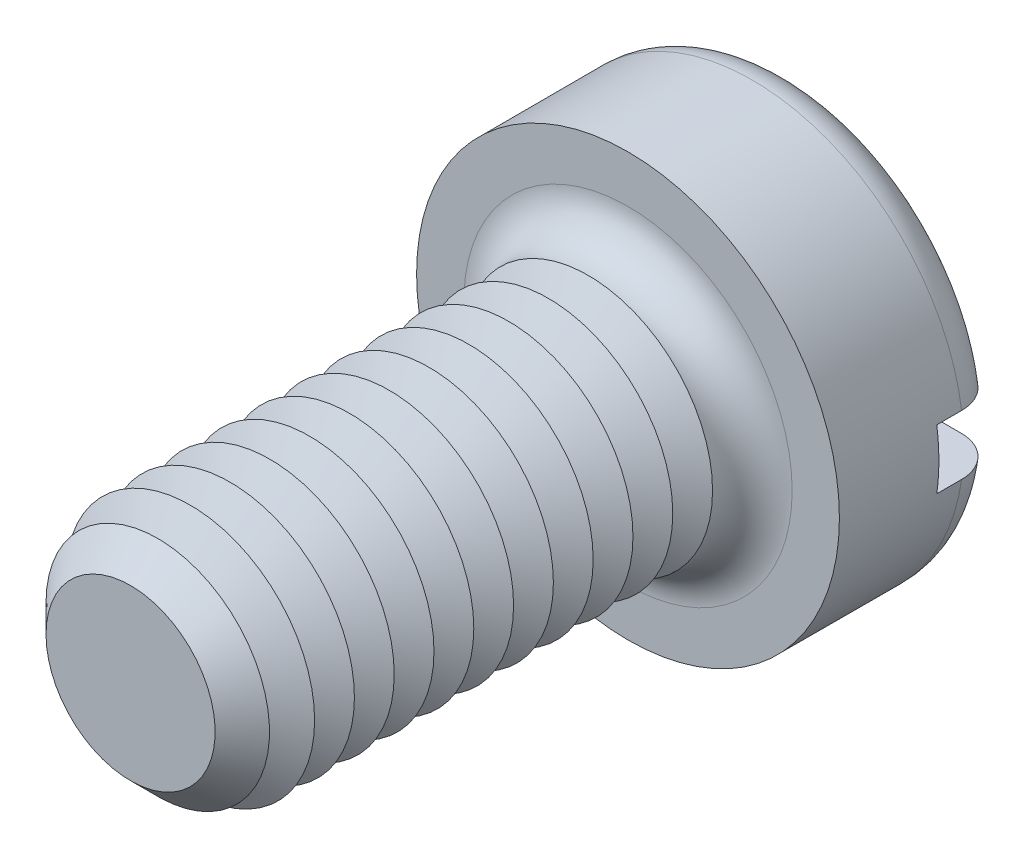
ISO-10303-21;
HEADER;
FILE_DESCRIPTION(('STEP AP214'),'2;1');
FILE_NAME('part.step','',(''),(''),'','','');
FILE_SCHEMA(('AUTOMOTIVE_DESIGN { 1 0 10303 214 1 1 1 1 }'));
ENDSEC;
DATA;
#1=APPLICATION_CONTEXT('core data for automotive mechanical design processes');
#2=APPLICATION_PROTOCOL_DEFINITION('international standard','automotive_design',2000,#1);
#3=PRODUCT_CONTEXT('',#1,'mechanical');
#4=PRODUCT('Part','Part','',(#3));
#5=PRODUCT_RELATED_PRODUCT_CATEGORY('part','',(#4));
#6=PRODUCT_DEFINITION_FORMATION('','',#4);
#7=PRODUCT_DEFINITION_CONTEXT('part definition',#1,'design');
#8=PRODUCT_DEFINITION('design','',#6,#7);
#9=PRODUCT_DEFINITION_SHAPE('','',#8);
#10=(LENGTH_UNIT() NAMED_UNIT(*) SI_UNIT(.MILLI.,.METRE.));
#11=(NAMED_UNIT(*) PLANE_ANGLE_UNIT() SI_UNIT($,.RADIAN.));
#12=(NAMED_UNIT(*) SI_UNIT($,.STERADIAN.) SOLID_ANGLE_UNIT());
#13=UNCERTAINTY_MEASURE_WITH_UNIT(LENGTH_MEASURE(1.E-05),#10,'distance_accuracy_value','');
#14=(GEOMETRIC_REPRESENTATION_CONTEXT(3) GLOBAL_UNCERTAINTY_ASSIGNED_CONTEXT((#13)) GLOBAL_UNIT_ASSIGNED_CONTEXT((#10,
#11,#12)) REPRESENTATION_CONTEXT('',''));
#15=CARTESIAN_POINT('',(0.,0.,0.));
#16=DIRECTION('',(0.,0.,1.));
#17=DIRECTION('',(1.,0.,0.));
#18=AXIS2_PLACEMENT_3D('',#15,#16,#17);
#19=CARTESIAN_POINT('',(0.,0.,-3.3));
#20=DIRECTION('',(0.,0.,1.));
#21=DIRECTION('',(1.,0.,0.));
#22=AXIS2_PLACEMENT_3D('',#19,#20,#21);
#23=PLANE('',#22);
#24=CARTESIAN_POINT('',(0.,0.,-3.3));
#25=DIRECTION('',(0.,0.,1.));
#26=DIRECTION('',(1.,0.,0.));
#27=AXIS2_PLACEMENT_3D('',#24,#25,#26);
#28=CIRCLE('',#27,3.45);
#29=CARTESIAN_POINT('',(-3.39742549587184,0.6,-3.3));
#30=VERTEX_POINT('',#29);
#31=CARTESIAN_POINT('',(3.39742549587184,0.6,-3.3));
#32=VERTEX_POINT('',#31);
#33=EDGE_CURVE('E116',#30,#32,#28,.F.);
#34=ORIENTED_EDGE('',*,*,#33,.T.);
#35=DIRECTION('',(1.,0.,0.));
#36=VECTOR('',#35,1.);
#37=CARTESIAN_POINT('',(-4.25,0.600000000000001,-3.3));
#38=LINE('',#37,#36);
#39=EDGE_CURVE('E111',#30,#32,#38,.T.);
#40=ORIENTED_EDGE('',*,*,#39,.F.);
#41=EDGE_LOOP('',(#34,#40));
#42=FACE_BOUND('',#41,.T.);
#43=ADVANCED_FACE('F39',(#42),#23,.F.);
#44=CARTESIAN_POINT('',(0.,0.,-2.5));
#45=DIRECTION('',(0.,0.,1.));
#46=DIRECTION('',(1.,0.,0.));
#47=AXIS2_PLACEMENT_3D('',#44,#45,#46);
#48=TOROIDAL_SURFACE('',#47,3.45,0.8);
#49=CARTESIAN_POINT('',(-4.06369072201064,0.600000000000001,-2.95537828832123));
#50=CARTESIAN_POINT('',(-4.03774340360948,0.600000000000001,-2.99245078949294));
#51=CARTESIAN_POINT('',(-4.00861849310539,0.600000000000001,-3.02734231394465));
#52=CARTESIAN_POINT('',(-3.94488199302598,0.600000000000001,-3.0917502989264));
#53=CARTESIAN_POINT('',(-3.91026320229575,0.600000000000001,-3.12125959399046));
#54=CARTESIAN_POINT('',(-3.83660561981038,0.600000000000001,-3.17403695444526));
#55=CARTESIAN_POINT('',(-3.79757117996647,0.6,-3.19731109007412));
#56=CARTESIAN_POINT('',(-3.71618817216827,0.6,-3.23703443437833));
#57=CARTESIAN_POINT('',(-3.67384041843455,0.6,-3.25348531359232));
#58=CARTESIAN_POINT('',(-3.58661930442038,0.6,-3.2792758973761));
#59=CARTESIAN_POINT('',(-3.54172669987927,0.6,-3.288550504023));
#60=CARTESIAN_POINT('',(-3.45102322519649,0.6,-3.29952632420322));
#61=CARTESIAN_POINT('',(-3.40521225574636,0.6,-3.30122671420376));
#62=CARTESIAN_POINT('',(-3.31340831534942,0.6,-3.29701196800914));
#63=CARTESIAN_POINT('',(-3.26741940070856,0.6,-3.29100823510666));
#64=CARTESIAN_POINT('',(-3.17708556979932,0.6,-3.27141469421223));
#65=CARTESIAN_POINT('',(-3.13274074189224,0.6,-3.25782447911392));
#66=CARTESIAN_POINT('',(-3.0466814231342,0.6,-3.22332549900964));
#67=CARTESIAN_POINT('',(-3.00498444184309,0.6,-3.20237301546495));
#68=CARTESIAN_POINT('',(-2.92572251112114,0.6,-3.15372961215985));
#69=CARTESIAN_POINT('',(-2.88815755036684,0.6,-3.12603871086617));
#70=CARTESIAN_POINT('',(-2.81847654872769,0.6,-3.06483322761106));
#71=CARTESIAN_POINT('',(-2.78633186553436,0.6,-3.03135128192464));
#72=CARTESIAN_POINT('',(-2.72824805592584,0.6,-2.95937651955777));
#73=CARTESIAN_POINT('',(-2.70230829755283,0.6,-2.92088421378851));
#74=CARTESIAN_POINT('',(-2.65791262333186,0.6,-2.84074227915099));
#75=CARTESIAN_POINT('',(-2.63932560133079,0.6,-2.79916531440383));
#76=CARTESIAN_POINT('',(-2.60958432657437,0.6,-2.7134333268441));
#77=CARTESIAN_POINT('',(-2.59842889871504,0.6,-2.66927871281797));
#78=CARTESIAN_POINT('',(-2.58411140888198,0.6,-2.58073966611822));
#79=CARTESIAN_POINT('',(-2.58077086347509,0.6,-2.5363840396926));
#80=CARTESIAN_POINT('',(-2.58167367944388,0.6,-2.44775208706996));
#81=CARTESIAN_POINT('',(-2.58591644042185,0.6,-2.40347575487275));
#82=CARTESIAN_POINT('',(-2.60175154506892,0.6,-2.31675105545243));
#83=CARTESIAN_POINT('',(-2.61326489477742,0.6,-2.27428821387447));
#84=CARTESIAN_POINT('',(-2.6431863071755,0.6,-2.19186794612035));
#85=CARTESIAN_POINT('',(-2.66159465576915,0.6,-2.15191062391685));
#86=CARTESIAN_POINT('',(-2.70494650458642,0.6,-2.07517696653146));
#87=CARTESIAN_POINT('',(-2.72995486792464,0.6,-2.03843731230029));
#88=CARTESIAN_POINT('',(-2.7856570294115,0.6,-1.96955746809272));
#89=CARTESIAN_POINT('',(-2.81635145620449,0.6,-1.93741778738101));
#90=CARTESIAN_POINT('',(-2.88329572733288,0.6,-1.87788048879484));
#91=CARTESIAN_POINT('',(-2.91965530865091,0.6,-1.85060625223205));
#92=CARTESIAN_POINT('',(-2.9963658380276,0.6,-1.80241044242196));
#93=CARTESIAN_POINT('',(-3.03671721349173,0.6,-1.78148955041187));
#94=CARTESIAN_POINT('',(-3.12111125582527,0.6,-1.74619829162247));
#95=CARTESIAN_POINT('',(-3.16521020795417,0.6,-1.73196239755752));
#96=CARTESIAN_POINT('',(-3.25516487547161,0.6,-1.71103773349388));
#97=CARTESIAN_POINT('',(-3.30102068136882,0.6,-1.70434935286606));
#98=CARTESIAN_POINT('',(-3.39352689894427,0.6,-1.69870104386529));
#99=CARTESIAN_POINT('',(-3.44018061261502,0.6,-1.69979487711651));
#100=CARTESIAN_POINT('',(-3.53263583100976,0.6,-1.70983959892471));
#101=CARTESIAN_POINT('',(-3.57843734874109,0.6,-1.71879036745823));
#102=CARTESIAN_POINT('',(-3.66763544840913,0.6,-1.74426972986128));
#103=CARTESIAN_POINT('',(-3.71104292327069,0.6,-1.76076015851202));
#104=CARTESIAN_POINT('',(-3.79442616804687,0.6,-1.80087686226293));
#105=CARTESIAN_POINT('',(-3.83440212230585,0.600000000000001,-1.82450275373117));
#106=CARTESIAN_POINT('',(-3.90929765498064,0.600000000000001,-1.87793548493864));
#107=CARTESIAN_POINT('',(-3.94426963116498,0.600000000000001,-1.90766887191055));
#108=CARTESIAN_POINT('',(-4.00864839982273,0.600000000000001,-1.9726503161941));
#109=CARTESIAN_POINT('',(-4.03805555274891,0.600000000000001,-2.00789801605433));
#110=CARTESIAN_POINT('',(-4.09009460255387,0.600000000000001,-2.08244463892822));
#111=CARTESIAN_POINT('',(-4.11280448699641,0.600000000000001,-2.12168912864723));
#112=CARTESIAN_POINT('',(-4.15124086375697,0.600000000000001,-2.2034588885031));
#113=CARTESIAN_POINT('',(-4.16696802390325,0.600000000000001,-2.24598384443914));
#114=CARTESIAN_POINT('',(-4.19085131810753,0.600000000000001,-2.33267862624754));
#115=CARTESIAN_POINT('',(-4.19907708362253,0.600000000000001,-2.37682928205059));
#116=CARTESIAN_POINT('',(-4.2079638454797,0.600000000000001,-2.46589754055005));
#117=CARTESIAN_POINT('',(-4.20862315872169,0.600000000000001,-2.51081531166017));
#118=CARTESIAN_POINT('',(-4.20236829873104,0.600000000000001,-2.59993343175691));
#119=CARTESIAN_POINT('',(-4.19548454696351,0.600000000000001,-2.64413593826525));
#120=CARTESIAN_POINT('',(-4.17439924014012,0.600000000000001,-2.73071930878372));
#121=CARTESIAN_POINT('',(-4.16020675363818,0.600000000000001,-2.77310235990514));
#122=CARTESIAN_POINT('',(-4.1318825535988,0.600000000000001,-2.83880495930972));
#123=CARTESIAN_POINT('',(-4.11991183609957,0.600000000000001,-2.86307959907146));
#124=CARTESIAN_POINT('',(-4.09356927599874,0.600000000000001,-2.91028856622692));
#125=CARTESIAN_POINT('',(-4.07919744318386,0.600000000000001,-2.9332228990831));
#126=CARTESIAN_POINT('',(-4.06369072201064,0.600000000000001,-2.95537828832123));
#127=B_SPLINE_CURVE_WITH_KNOTS('',3,(#49,#50,#51,#52,#53,#54,#55,#56,#57,#58,#59,#60,#61,#62,
#63,#64,#65,#66,#67,#68,#69,#70,#71,#72,#73,#74,#75,#76,#77,#78,#79,#80,#81,#82,#83,#84,#85,#86,
#87,#88,#89,#90,#91,#92,#93,#94,#95,#96,#97,#98,#99,#100,#101,#102,#103,#104,#105,#106,#107,
#108,#109,#110,#111,#112,#113,#114,#115,#116,#117,#118,#119,#120,#121,#122,#123,#124,#125,#126),
.UNSPECIFIED.,.T.,.F.,(4,2,2,2,2,2,2,2,2,2,2,2,2,2,2,2,2,2,2,2,2,2,2,2,2,2,2,2,2,2,2,2,2,2,2,2,
2,2,4),(0.,0.13565225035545,0.271483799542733,0.407182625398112,0.542848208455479,
0.679730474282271,0.816627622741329,0.955113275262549,1.09360635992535,1.23293614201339,
1.37226554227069,1.51083389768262,1.64938813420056,1.78534653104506,1.92128342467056,
2.0540840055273,2.18687407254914,2.31824564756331,2.44962267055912,2.58234229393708,
2.71507659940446,2.85080630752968,2.98655056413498,3.12491938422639,3.26329534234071,
3.40262816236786,3.54195885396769,3.68059194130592,3.81921757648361,3.95626453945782,
4.09330262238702,4.2286754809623,4.36403538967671,4.49812564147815,4.63224572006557,
4.76582687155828,4.89924267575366,4.98031194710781,5.0613808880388),.UNSPECIFIED.);
#128=CARTESIAN_POINT('',(-4.20743389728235,0.600000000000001,-2.50000000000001));
#129=VERTEX_POINT('',#128);
#130=EDGE_CURVE('E273',#129,#30,#127,.T.);
#131=ORIENTED_EDGE('',*,*,#130,.F.);
#132=CARTESIAN_POINT('',(0.,0.,-2.5));
#133=DIRECTION('',(0.,0.,1.));
#134=DIRECTION('',(1.,0.,0.));
#135=AXIS2_PLACEMENT_3D('',#132,#133,#134);
#136=CIRCLE('',#135,4.25);
#137=CARTESIAN_POINT('',(4.20743389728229,0.599999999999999,-2.5));
#138=VERTEX_POINT('',#137);
#139=EDGE_CURVE('E125',#138,#129,#136,.T.);
#140=ORIENTED_EDGE('',*,*,#139,.F.);
#141=CARTESIAN_POINT('',(2.63947327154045,0.6,-2.79608831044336));
#142=CARTESIAN_POINT('',(2.65655980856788,0.6,-2.83790320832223));
#143=CARTESIAN_POINT('',(2.67725642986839,0.6,-2.87828303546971));
#144=CARTESIAN_POINT('',(2.72519250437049,0.6,-2.95500233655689));
#145=CARTESIAN_POINT('',(2.75244152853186,0.6,-2.9913357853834));
#146=CARTESIAN_POINT('',(2.81257938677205,0.6,-3.05889430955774));
#147=CARTESIAN_POINT('',(2.84545995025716,0.6,-3.09012674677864));
#148=CARTESIAN_POINT('',(2.91591143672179,0.6,-3.14672620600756));
#149=CARTESIAN_POINT('',(2.95348119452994,0.6,-3.17209468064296));
#150=CARTESIAN_POINT('',(3.03291143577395,0.6,-3.21669611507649));
#151=CARTESIAN_POINT('',(3.07483186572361,0.6,-3.23582234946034));
#152=CARTESIAN_POINT('',(3.16126659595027,0.6,-3.26686062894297));
#153=CARTESIAN_POINT('',(3.2057811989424,0.6,-3.27877183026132));
#154=CARTESIAN_POINT('',(3.29669878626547,0.6,-3.29514603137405));
#155=CARTESIAN_POINT('',(3.34311773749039,0.6,-3.29952056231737));
#156=CARTESIAN_POINT('',(3.43603189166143,0.6,-3.30040472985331));
#157=CARTESIAN_POINT('',(3.48252709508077,0.6,-3.29691431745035));
#158=CARTESIAN_POINT('',(3.57420049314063,0.6,-3.28214240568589));
#159=CARTESIAN_POINT('',(3.61938038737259,0.6,-3.27087147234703));
#160=CARTESIAN_POINT('',(3.70717477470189,0.6,-3.24082890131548));
#161=CARTESIAN_POINT('',(3.74978938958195,0.6,-3.22205762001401));
#162=CARTESIAN_POINT('',(3.83078828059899,0.6,-3.17773607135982));
#163=CARTESIAN_POINT('',(3.86921015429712,0.599999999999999,-3.15225453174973));
#164=CARTESIAN_POINT('',(3.94116038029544,0.599999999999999,-3.09512672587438));
#165=CARTESIAN_POINT('',(3.9746890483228,0.599999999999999,-3.06348085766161));
#166=CARTESIAN_POINT('',(4.03545911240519,0.599999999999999,-2.99534640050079));
#167=CARTESIAN_POINT('',(4.06277344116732,0.599999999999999,-2.95892285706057));
#168=CARTESIAN_POINT('',(4.11082191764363,0.599999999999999,-2.88196698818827));
#169=CARTESIAN_POINT('',(4.13155647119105,0.599999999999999,-2.84143491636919));
#170=CARTESIAN_POINT('',(4.16563480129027,0.599999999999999,-2.75787550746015));
#171=CARTESIAN_POINT('',(4.1790544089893,0.599999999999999,-2.71487908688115));
#172=CARTESIAN_POINT('',(4.19843340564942,0.599999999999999,-2.62723691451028));
#173=CARTESIAN_POINT('',(4.20439310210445,0.599999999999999,-2.58259123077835));
#174=CARTESIAN_POINT('',(4.2086595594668,0.599999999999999,-2.49321831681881));
#175=CARTESIAN_POINT('',(4.20701422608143,0.599999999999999,-2.4484933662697));
#176=CARTESIAN_POINT('',(4.1962295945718,0.599999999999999,-2.35995704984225));
#177=CARTESIAN_POINT('',(4.18709040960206,0.599999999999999,-2.31614567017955));
#178=CARTESIAN_POINT('',(4.16160290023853,0.599999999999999,-2.23072100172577));
#179=CARTESIAN_POINT('',(4.14526169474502,0.599999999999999,-2.18910558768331));
#180=CARTESIAN_POINT('',(4.10585410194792,0.599999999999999,-2.10919238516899));
#181=CARTESIAN_POINT('',(4.08278762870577,0.599999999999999,-2.07089463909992));
#182=CARTESIAN_POINT('',(4.030487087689,0.599999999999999,-1.99851484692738));
#183=CARTESIAN_POINT('',(4.00122628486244,0.599999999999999,-1.9644521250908));
#184=CARTESIAN_POINT('',(3.93744772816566,0.599999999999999,-1.90166877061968));
#185=CARTESIAN_POINT('',(3.90292977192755,0.599999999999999,-1.87294834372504));
#186=CARTESIAN_POINT('',(3.82928727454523,0.599999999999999,-1.82137853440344));
#187=CARTESIAN_POINT('',(3.79012374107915,0.6,-1.79858484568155));
#188=CARTESIAN_POINT('',(3.70856025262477,0.6,-1.75980712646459));
#189=CARTESIAN_POINT('',(3.66616010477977,0.6,-1.74382350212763));
#190=CARTESIAN_POINT('',(3.57878495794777,0.6,-1.71891499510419));
#191=CARTESIAN_POINT('',(3.53378519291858,0.6,-1.71007699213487));
#192=CARTESIAN_POINT('',(3.44294322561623,0.6,-1.69998722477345));
#193=CARTESIAN_POINT('',(3.3971009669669,0.6,-1.69873596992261));
#194=CARTESIAN_POINT('',(3.30531297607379,0.6,-1.70385439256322));
#195=CARTESIAN_POINT('',(3.25937213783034,0.6,-1.71031204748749));
#196=CARTESIAN_POINT('',(3.1692099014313,0.6,-1.73080107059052));
#197=CARTESIAN_POINT('',(3.12498860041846,0.6,-1.74483286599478));
#198=CARTESIAN_POINT('',(3.03926209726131,0.6,-1.78018941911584));
#199=CARTESIAN_POINT('',(2.99777407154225,0.6,-1.80155586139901));
#200=CARTESIAN_POINT('',(2.91899881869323,0.6,-1.85098881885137));
#201=CARTESIAN_POINT('',(2.88171158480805,0.6,-1.8790553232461));
#202=CARTESIAN_POINT('',(2.81266124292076,0.6,-1.94094884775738));
#203=CARTESIAN_POINT('',(2.78086710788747,0.6,-1.97474122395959));
#204=CARTESIAN_POINT('',(2.72353615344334,0.6,-2.0472724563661));
#205=CARTESIAN_POINT('',(2.69799841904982,0.6,-2.08601058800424));
#206=CARTESIAN_POINT('',(2.65444718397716,0.6,-2.16655019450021));
#207=CARTESIAN_POINT('',(2.63629889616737,0.6,-2.20827875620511));
#208=CARTESIAN_POINT('',(2.60744942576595,0.6,-2.29424821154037));
#209=CARTESIAN_POINT('',(2.59674901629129,0.6,-2.33848936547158));
#210=CARTESIAN_POINT('',(2.5833312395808,0.6,-2.42714258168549));
#211=CARTESIAN_POINT('',(2.58043995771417,0.6,-2.47152848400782));
#212=CARTESIAN_POINT('',(2.58224493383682,0.6,-2.56010574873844));
#213=CARTESIAN_POINT('',(2.58693104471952,0.6,-2.60429729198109));
#214=CARTESIAN_POINT('',(2.60020046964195,0.6,-2.67311978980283));
#215=CARTESIAN_POINT('',(2.60635343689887,0.6,-2.69824441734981));
#216=CARTESIAN_POINT('',(2.62110140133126,0.6,-2.74776540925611));
#217=CARTESIAN_POINT('',(2.62969634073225,0.6,-2.77216179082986));
#218=CARTESIAN_POINT('',(2.63947327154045,0.6,-2.79608831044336));
#219=B_SPLINE_CURVE_WITH_KNOTS('',3,(#141,#142,#143,#144,#145,#146,#147,#148,#149,#150,#151,
#152,#153,#154,#155,#156,#157,#158,#159,#160,#161,#162,#163,#164,#165,#166,#167,#168,#169,#170,
#171,#172,#173,#174,#175,#176,#177,#178,#179,#180,#181,#182,#183,#184,#185,#186,#187,#188,#189,
#190,#191,#192,#193,#194,#195,#196,#197,#198,#199,#200,#201,#202,#203,#204,#205,#206,#207,#208,
#209,#210,#211,#212,#213,#214,#215,#216,#217,#218),.UNSPECIFIED.,.T.,.F.,(4,2,2,2,2,2,2,2,2,2,2,
2,2,2,2,2,2,2,2,2,2,2,2,2,2,2,2,2,2,2,2,2,2,2,2,2,2,2,4),(0.,0.135416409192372,
0.271031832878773,0.406449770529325,0.541834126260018,0.679424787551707,0.817031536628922,
0.956242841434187,1.09545501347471,1.23447850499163,1.37349539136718,1.51114036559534,
1.64877645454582,1.78470267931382,1.92062051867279,2.05510117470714,2.1895762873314,
2.32320547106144,2.45683263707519,2.59032801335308,2.72382509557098,2.85791055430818,
2.99200117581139,3.12730969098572,3.26262627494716,3.39956435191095,3.53651162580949,
3.67503685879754,3.81356990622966,3.95290367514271,4.09223721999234,4.23075602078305,
4.36925455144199,4.50509949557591,4.6409585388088,4.77376594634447,4.90639565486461,
4.98388287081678,5.06136825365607),.UNSPECIFIED.);
#220=EDGE_CURVE('E275',#32,#138,#219,.T.);
#221=ORIENTED_EDGE('',*,*,#220,.F.);
#222=ORIENTED_EDGE('',*,*,#33,.F.);
#223=EDGE_LOOP('',(#131,#140,#221,#222));
#224=FACE_BOUND('',#223,.T.);
#225=ADVANCED_FACE('F257',(#224),#48,.T.);
#226=CARTESIAN_POINT('',(0.,0.,-3.3));
#227=DIRECTION('',(0.,0.,1.));
#228=DIRECTION('',(1.,0.,0.));
#229=AXIS2_PLACEMENT_3D('',#226,#227,#228);
#230=CYLINDRICAL_SURFACE('',#229,4.25);
#231=DIRECTION('',(0.,0.,1.));
#232=VECTOR('',#231,1.);
#233=CARTESIAN_POINT('',(4.20743389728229,0.599999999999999,-3.3));
#234=LINE('',#233,#232);
#235=CARTESIAN_POINT('',(4.20743389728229,0.599999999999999,-2.));
#236=VERTEX_POINT('',#235);
#237=EDGE_CURVE('E290',#138,#236,#234,.T.);
#238=ORIENTED_EDGE('',*,*,#237,.F.);
#239=ORIENTED_EDGE('',*,*,#139,.T.);
#240=DIRECTION('',(0.,0.,1.));
#241=VECTOR('',#240,1.);
#242=CARTESIAN_POINT('',(-4.20743389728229,0.600000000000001,-3.3));
#243=LINE('',#242,#241);
#244=CARTESIAN_POINT('',(-4.20743389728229,0.600000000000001,-2.));
#245=VERTEX_POINT('',#244);
#246=EDGE_CURVE('E63',#245,#129,#243,.F.);
#247=ORIENTED_EDGE('',*,*,#246,.F.);
#248=CARTESIAN_POINT('',(0.,0.,-2.));
#249=DIRECTION('',(0.,0.,-1.));
#250=DIRECTION('',(-1.,0.,0.));
#251=AXIS2_PLACEMENT_3D('',#248,#249,#250);
#252=CIRCLE('',#251,4.25);
#253=CARTESIAN_POINT('',(-4.20743389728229,-0.599999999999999,-2.));
#254=VERTEX_POINT('',#253);
#255=EDGE_CURVE('E43',#245,#254,#252,.F.);
#256=ORIENTED_EDGE('',*,*,#255,.T.);
#257=DIRECTION('',(0.,0.,1.));
#258=VECTOR('',#257,1.);
#259=CARTESIAN_POINT('',(-4.20743389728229,-0.599999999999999,-3.3));
#260=LINE('',#259,#258);
#261=CARTESIAN_POINT('',(-4.20743389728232,-0.599999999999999,-2.5));
#262=VERTEX_POINT('',#261);
#263=EDGE_CURVE('E287',#262,#254,#260,.T.);
#264=ORIENTED_EDGE('',*,*,#263,.F.);
#265=CARTESIAN_POINT('',(4.20743389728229,-0.600000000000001,-2.5));
#266=VERTEX_POINT('',#265);
#267=EDGE_CURVE('E127',#262,#266,#136,.T.);
#268=ORIENTED_EDGE('',*,*,#267,.T.);
#269=DIRECTION('',(0.,0.,1.));
#270=VECTOR('',#269,1.);
#271=CARTESIAN_POINT('',(4.20743389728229,-0.600000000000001,-3.3));
#272=LINE('',#271,#270);
#273=CARTESIAN_POINT('',(4.20743389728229,-0.600000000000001,-2.));
#274=VERTEX_POINT('',#273);
#275=EDGE_CURVE('E55',#274,#266,#272,.F.);
#276=ORIENTED_EDGE('',*,*,#275,.F.);
#277=EDGE_CURVE('E11',#274,#236,#252,.F.);
#278=ORIENTED_EDGE('',*,*,#277,.T.);
#279=EDGE_LOOP('',(#238,#239,#247,#256,#264,#268,#276,#278));
#280=FACE_BOUND('',#279,.T.);
#281=CARTESIAN_POINT('',(0.,0.,0.));
#282=DIRECTION('',(0.,0.,1.));
#283=DIRECTION('',(1.,0.,0.));
#284=AXIS2_PLACEMENT_3D('',#281,#282,#283);
#285=CIRCLE('',#284,4.25);
#286=CARTESIAN_POINT('',(4.25,0.,0.));
#287=VERTEX_POINT('',#286);
#288=EDGE_CURVE('E293',#287,#287,#285,.T.);
#289=ORIENTED_EDGE('',*,*,#288,.F.);
#290=EDGE_LOOP('',(#289));
#291=FACE_BOUND('',#290,.T.);
#292=ADVANCED_FACE('F253',(#280,#291),#230,.T.);
#293=CARTESIAN_POINT('',(3.39742549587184,-0.6,-3.3));
#294=VERTEX_POINT('',#293);
#295=CARTESIAN_POINT('',(-3.39742549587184,-0.6,-3.3));
#296=VERTEX_POINT('',#295);
#297=EDGE_CURVE('E109',#294,#296,#28,.F.);
#298=ORIENTED_EDGE('',*,*,#297,.T.);
#299=DIRECTION('',(-1.,0.,0.));
#300=VECTOR('',#299,1.);
#301=CARTESIAN_POINT('',(-4.25,-0.599999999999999,-3.3));
#302=LINE('',#301,#300);
#303=EDGE_CURVE('E96',#294,#296,#302,.T.);
#304=ORIENTED_EDGE('',*,*,#303,.F.);
#305=EDGE_LOOP('',(#298,#304));
#306=FACE_BOUND('',#305,.T.);
#307=ADVANCED_FACE('F108',(#306),#23,.F.);
#308=CARTESIAN_POINT('',(0.,0.,0.));
#309=DIRECTION('',(0.,0.,1.));
#310=DIRECTION('',(1.,0.,0.));
#311=AXIS2_PLACEMENT_3D('',#308,#309,#310);
#312=PLANE('',#311);
#313=CARTESIAN_POINT('',(0.,0.,0.));
#314=DIRECTION('',(0.,0.,1.));
#315=DIRECTION('',(1.,0.,0.));
#316=AXIS2_PLACEMENT_3D('',#313,#314,#315);
#317=CIRCLE('',#316,3.3);
#318=CARTESIAN_POINT('',(3.3,0.,0.));
#319=VERTEX_POINT('',#318);
#320=EDGE_CURVE('E115',#319,#319,#317,.F.);
#321=ORIENTED_EDGE('',*,*,#320,.T.);
#322=EDGE_LOOP('',(#321));
#323=FACE_BOUND('',#322,.T.);
#324=ORIENTED_EDGE('',*,*,#288,.T.);
#325=EDGE_LOOP('',(#324));
#326=FACE_BOUND('',#325,.T.);
#327=ADVANCED_FACE('F252',(#323,#326),#312,.T.);
#328=CARTESIAN_POINT('',(-4.06369072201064,-0.599999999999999,-2.95537828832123));
#329=CARTESIAN_POINT('',(-4.08928577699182,-0.599999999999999,-2.91880204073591));
#330=CARTESIAN_POINT('',(-4.11182555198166,-0.599999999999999,-2.88005030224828));
#331=CARTESIAN_POINT('',(-4.15010404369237,-0.599999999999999,-2.79928452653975));
#332=CARTESIAN_POINT('',(-4.16583526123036,-0.599999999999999,-2.75726695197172));
#333=CARTESIAN_POINT('',(-4.19000286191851,-0.599999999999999,-2.67118996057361));
#334=CARTESIAN_POINT('',(-4.19844101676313,-0.599999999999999,-2.62713104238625));
#335=CARTESIAN_POINT('',(-4.20777174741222,-0.599999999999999,-2.53823222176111));
#336=CARTESIAN_POINT('',(-4.20866608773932,-0.599999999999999,-2.49339250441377));
#337=CARTESIAN_POINT('',(-4.20289683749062,-0.599999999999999,-2.40433856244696));
#338=CARTESIAN_POINT('',(-4.19625607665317,-0.599999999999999,-2.36012285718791));
#339=CARTESIAN_POINT('',(-4.17565084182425,-0.599999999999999,-2.27343166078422));
#340=CARTESIAN_POINT('',(-4.16168615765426,-0.599999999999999,-2.23095621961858));
#341=CARTESIAN_POINT('',(-4.12683188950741,-0.599999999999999,-2.14890863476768));
#342=CARTESIAN_POINT('',(-4.10593663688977,-0.599999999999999,-2.10933890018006));
#343=CARTESIAN_POINT('',(-4.05783763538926,-0.599999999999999,-2.03424145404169));
#344=CARTESIAN_POINT('',(-4.03063375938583,-0.599999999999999,-1.99871382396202));
#345=CARTESIAN_POINT('',(-3.97052236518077,-0.599999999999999,-1.93246905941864));
#346=CARTESIAN_POINT('',(-3.93758114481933,-0.599999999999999,-1.90178251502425));
#347=CARTESIAN_POINT('',(-3.86706007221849,-0.599999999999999,-1.84630837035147));
#348=CARTESIAN_POINT('',(-3.82948001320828,-0.6,-1.82152103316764));
#349=CARTESIAN_POINT('',(-3.75033766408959,-0.6,-1.77826995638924));
#350=CARTESIAN_POINT('',(-3.70873831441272,-0.6,-1.7598740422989));
#351=CARTESIAN_POINT('',(-3.62306661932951,-0.6,-1.73023196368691));
#352=CARTESIAN_POINT('',(-3.57899411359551,-0.6,-1.71898626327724));
#353=CARTESIAN_POINT('',(-3.48904845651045,-0.6,-1.70382025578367));
#354=CARTESIAN_POINT('',(-3.44315982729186,-0.6,-1.69999172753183));
#355=CARTESIAN_POINT('',(-3.35138360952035,-0.6,-1.7000083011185));
#356=CARTESIAN_POINT('',(-3.30549602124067,-0.6,-1.70385391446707));
#357=CARTESIAN_POINT('',(-3.21452492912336,-0.6,-1.71917227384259));
#358=CARTESIAN_POINT('',(-3.16945455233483,-0.6,-1.73072307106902));
#359=CARTESIAN_POINT('',(-3.08188104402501,-0.6,-1.76120640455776));
#360=CARTESIAN_POINT('',(-3.0393780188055,-0.6,-1.78013924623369));
#361=CARTESIAN_POINT('',(-2.95805296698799,-0.6,-1.82493384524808));
#362=CARTESIAN_POINT('',(-2.9192403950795,-0.6,-1.85081278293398));
#363=CARTESIAN_POINT('',(-2.84656695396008,-0.6,-1.90878317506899));
#364=CARTESIAN_POINT('',(-2.81270591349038,-0.6,-1.94087441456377));
#365=CARTESIAN_POINT('',(-2.75131050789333,-0.6,-2.01002500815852));
#366=CARTESIAN_POINT('',(-2.72371339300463,-0.6,-2.04702860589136));
#367=CARTESIAN_POINT('',(-2.67528742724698,-0.6,-2.12522869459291));
#368=CARTESIAN_POINT('',(-2.65445765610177,-0.6,-2.1664246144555));
#369=CARTESIAN_POINT('',(-2.62065354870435,-0.6,-2.25087266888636));
#370=CARTESIAN_POINT('',(-2.60751663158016,-0.6,-2.29405971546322));
#371=CARTESIAN_POINT('',(-2.58885106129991,-0.6,-2.38204659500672));
#372=CARTESIAN_POINT('',(-2.58332131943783,-0.6,-2.42684619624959));
#373=CARTESIAN_POINT('',(-2.58009777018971,-0.6,-2.51580379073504));
#374=CARTESIAN_POINT('',(-2.58224575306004,-0.6,-2.55995612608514));
#375=CARTESIAN_POINT('',(-2.59395205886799,-0.6,-2.64726495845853));
#376=CARTESIAN_POINT('',(-2.60351013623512,-0.6,-2.69042148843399));
#377=CARTESIAN_POINT('',(-2.62967159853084,-0.6,-2.77438771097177));
#378=CARTESIAN_POINT('',(-2.64625243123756,-0.6,-2.81520444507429));
#379=CARTESIAN_POINT('',(-2.68592348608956,-0.6,-2.89353901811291));
#380=CARTESIAN_POINT('',(-2.70901418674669,-0.6,-2.9310566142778));
#381=CARTESIAN_POINT('',(-2.7614318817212,-0.6,-3.00240040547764));
#382=CARTESIAN_POINT('',(-2.79085487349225,-0.6,-3.03615603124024));
#383=CARTESIAN_POINT('',(-2.85483456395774,-0.6,-3.09838834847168));
#384=CARTESIAN_POINT('',(-2.88939187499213,-0.6,-3.12686440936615));
#385=CARTESIAN_POINT('',(-2.96351967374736,-0.6,-3.17841283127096));
#386=CARTESIAN_POINT('',(-3.00318741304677,-0.6,-3.20134539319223));
#387=CARTESIAN_POINT('',(-3.08576649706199,-0.6,-3.24034364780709));
#388=CARTESIAN_POINT('',(-3.12867814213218,-0.6,-3.25640870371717));
#389=CARTESIAN_POINT('',(-3.21724048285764,-0.6,-3.28143816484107));
#390=CARTESIAN_POINT('',(-3.26292314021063,-0.6,-3.29028963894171));
#391=CARTESIAN_POINT('',(-3.35512527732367,-0.6,-3.30021681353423));
#392=CARTESIAN_POINT('',(-3.40164474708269,-0.6,-3.30129260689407));
#393=CARTESIAN_POINT('',(-3.49429978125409,-0.6,-3.29560589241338));
#394=CARTESIAN_POINT('',(-3.54043436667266,-0.6,-3.28882735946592));
#395=CARTESIAN_POINT('',(-3.63090382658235,-0.6,-3.26755492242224));
#396=CARTESIAN_POINT('',(-3.67523831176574,-0.6,-3.25305935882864));
#397=CARTESIAN_POINT('',(-3.76046509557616,-0.6,-3.21686867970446));
#398=CARTESIAN_POINT('',(-3.80138087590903,-0.599999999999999,-3.1952288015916));
#399=CARTESIAN_POINT('',(-3.8788986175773,-0.599999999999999,-3.14531817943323));
#400=CARTESIAN_POINT('',(-3.91550599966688,-0.599999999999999,-3.11705590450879));
#401=CARTESIAN_POINT('',(-3.97074313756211,-0.599999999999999,-3.06628809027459));
#402=CARTESIAN_POINT('',(-3.99100743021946,-0.599999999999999,-3.04553102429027));
#403=CARTESIAN_POINT('',(-4.02917385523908,-0.599999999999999,-3.00194762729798));
#404=CARTESIAN_POINT('',(-4.04707600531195,-0.599999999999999,-2.97912131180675));
#405=CARTESIAN_POINT('',(-4.06369072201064,-0.599999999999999,-2.95537828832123));
#406=B_SPLINE_CURVE_WITH_KNOTS('',3,(#328,#329,#330,#331,#332,#333,#334,#335,#336,#337,#338,
#339,#340,#341,#342,#343,#344,#345,#346,#347,#348,#349,#350,#351,#352,#353,#354,#355,#356,#357,
#358,#359,#360,#361,#362,#363,#364,#365,#366,#367,#368,#369,#370,#371,#372,#373,#374,#375,#376,
#377,#378,#379,#380,#381,#382,#383,#384,#385,#386,#387,#388,#389,#390,#391,#392,#393,#394,#395,
#396,#397,#398,#399,#400,#401,#402,#403,#404,#405),.UNSPECIFIED.,.T.,.F.,(4,2,2,2,2,2,2,2,2,2,2,
2,2,2,2,2,2,2,2,2,2,2,2,2,2,2,2,2,2,2,2,2,2,2,2,2,2,2,4),(0.,0.133821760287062,
0.267790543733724,0.401726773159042,0.535631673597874,0.669131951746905,0.802636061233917,
0.936249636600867,1.06986590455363,1.2042952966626,1.3387306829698,1.47455198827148,
1.61038210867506,1.74788249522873,1.88539204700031,2.02431612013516,2.16324594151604,
2.30252260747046,2.4417944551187,2.57960263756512,2.71739207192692,2.85215325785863,
2.98689515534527,3.11887666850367,3.25085380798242,3.38241030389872,3.51397647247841,
3.64769871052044,3.78143690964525,3.91826005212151,4.05509587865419,4.19403485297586,
4.33297216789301,4.47219345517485,4.61144469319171,4.74964356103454,4.887666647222,
4.97453605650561,5.06140481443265),.UNSPECIFIED.);
#407=EDGE_CURVE('E103',#296,#262,#406,.T.);
#408=ORIENTED_EDGE('',*,*,#407,.F.);
#409=ORIENTED_EDGE('',*,*,#297,.F.);
#410=CARTESIAN_POINT('',(2.63947327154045,-0.6,-2.79608831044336));
#411=CARTESIAN_POINT('',(2.62285766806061,-0.6,-2.75541510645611));
#412=CARTESIAN_POINT('',(2.60963282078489,-0.6,-2.71332585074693));
#413=CARTESIAN_POINT('',(2.59042394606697,-0.6,-2.62749460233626));
#414=CARTESIAN_POINT('',(2.58444686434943,-0.6,-2.58375106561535));
#415=CARTESIAN_POINT('',(2.57995287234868,-0.6,-2.49588524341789));
#416=CARTESIAN_POINT('',(2.58143477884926,-0.6,-2.45176301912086));
#417=CARTESIAN_POINT('',(2.59180622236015,-0.6,-2.36440906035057));
#418=CARTESIAN_POINT('',(2.60069434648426,-0.6,-2.32117715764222));
#419=CARTESIAN_POINT('',(2.62554964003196,-0.6,-2.23689909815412));
#420=CARTESIAN_POINT('',(2.6415022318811,-0.6,-2.19584863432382));
#421=CARTESIAN_POINT('',(2.67996913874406,-0.6,-2.11694797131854));
#422=CARTESIAN_POINT('',(2.70248409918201,-0.6,-2.07909808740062));
#423=CARTESIAN_POINT('',(2.75378972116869,-0.6,-2.00702296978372));
#424=CARTESIAN_POINT('',(2.7826732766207,-0.6,-1.97286389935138));
#425=CARTESIAN_POINT('',(2.84564717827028,-0.6,-1.90974167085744));
#426=CARTESIAN_POINT('',(2.87973812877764,-0.6,-1.88077911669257));
#427=CARTESIAN_POINT('',(2.95300941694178,-0.6,-1.82817307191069));
#428=CARTESIAN_POINT('',(2.99228920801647,-0.6,-1.8046680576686));
#429=CARTESIAN_POINT('',(3.07419050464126,-0.6,-1.76446470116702));
#430=CARTESIAN_POINT('',(3.11681231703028,-0.6,-1.74776698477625));
#431=CARTESIAN_POINT('',(3.20492149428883,-0.6,-1.72140945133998));
#432=CARTESIAN_POINT('',(3.25044365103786,-0.6,-1.71186578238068));
#433=CARTESIAN_POINT('',(3.34244451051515,-0.6,-1.70053183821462));
#434=CARTESIAN_POINT('',(3.38892324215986,-0.6,-1.69874179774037));
#435=CARTESIAN_POINT('',(3.48165030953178,-0.6,-1.70299737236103));
#436=CARTESIAN_POINT('',(3.52789766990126,-0.6,-1.70906439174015));
#437=CARTESIAN_POINT('',(3.61869999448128,-0.6,-1.72893768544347));
#438=CARTESIAN_POINT('',(3.6632550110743,-0.6,-1.742743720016));
#439=CARTESIAN_POINT('',(3.7490339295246,-0.6,-1.77760539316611));
#440=CARTESIAN_POINT('',(3.79028083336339,-0.600000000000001,-1.79860440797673));
#441=CARTESIAN_POINT('',(3.86860401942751,-0.600000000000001,-1.84731105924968));
#442=CARTESIAN_POINT('',(3.90568056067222,-0.600000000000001,-1.87501827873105));
#443=CARTESIAN_POINT('',(3.97412845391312,-0.600000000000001,-1.93599408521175));
#444=CARTESIAN_POINT('',(4.00556369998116,-0.600000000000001,-1.96919094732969));
#445=CARTESIAN_POINT('',(4.06233546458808,-0.600000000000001,-2.0404445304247));
#446=CARTESIAN_POINT('',(4.08767237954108,-0.600000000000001,-2.07850093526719));
#447=CARTESIAN_POINT('',(4.13122502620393,-0.600000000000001,-2.15791791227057));
#448=CARTESIAN_POINT('',(4.14951966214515,-0.600000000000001,-2.19923522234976));
#449=CARTESIAN_POINT('',(4.17884974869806,-0.600000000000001,-2.28437065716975));
#450=CARTESIAN_POINT('',(4.18988555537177,-0.600000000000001,-2.32818865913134));
#451=CARTESIAN_POINT('',(4.20430724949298,-0.600000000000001,-2.41670951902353));
#452=CARTESIAN_POINT('',(4.2077528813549,-0.600000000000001,-2.46140265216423));
#453=CARTESIAN_POINT('',(4.20706844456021,-0.600000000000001,-2.55073028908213));
#454=CARTESIAN_POINT('',(4.20293856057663,-0.600000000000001,-2.595364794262));
#455=CARTESIAN_POINT('',(4.18724926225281,-0.600000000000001,-2.68317733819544));
#456=CARTESIAN_POINT('',(4.17571081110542,-0.600000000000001,-2.72635912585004));
#457=CARTESIAN_POINT('',(4.14556645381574,-0.600000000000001,-2.81017999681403));
#458=CARTESIAN_POINT('',(4.12696052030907,-0.600000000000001,-2.85081907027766));
#459=CARTESIAN_POINT('',(4.08317014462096,-0.600000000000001,-2.92852328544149));
#460=CARTESIAN_POINT('',(4.0579684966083,-0.600000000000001,-2.96557872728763));
#461=CARTESIAN_POINT('',(4.00174565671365,-0.600000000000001,-3.034972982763));
#462=CARTESIAN_POINT('',(3.97072429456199,-0.600000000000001,-3.06731165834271));
#463=CARTESIAN_POINT('',(3.90349659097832,-0.600000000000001,-3.12662735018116));
#464=CARTESIAN_POINT('',(3.86725240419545,-0.600000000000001,-3.15356146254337));
#465=CARTESIAN_POINT('',(3.79079809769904,-0.600000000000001,-3.20104156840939));
#466=CARTESIAN_POINT('',(3.75058775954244,-0.6,-3.22158720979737));
#467=CARTESIAN_POINT('',(3.6668595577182,-0.6,-3.25595832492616));
#468=CARTESIAN_POINT('',(3.62330947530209,-0.6,-3.26970530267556));
#469=CARTESIAN_POINT('',(3.53453348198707,-0.6,-3.28979004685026));
#470=CARTESIAN_POINT('',(3.48930745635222,-0.6,-3.29612730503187));
#471=CARTESIAN_POINT('',(3.39787506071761,-0.6,-3.30128612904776));
#472=CARTESIAN_POINT('',(3.35166346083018,-0.6,-3.30001513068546));
#473=CARTESIAN_POINT('',(3.26009663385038,-0.6,-3.28980210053));
#474=CARTESIAN_POINT('',(3.21474142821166,-0.6,-3.28085987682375));
#475=CARTESIAN_POINT('',(3.12577990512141,-0.6,-3.2554540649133));
#476=CARTESIAN_POINT('',(3.08219120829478,-0.6,-3.23892872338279));
#477=CARTESIAN_POINT('',(2.99839730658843,-0.6,-3.1987810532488));
#478=CARTESIAN_POINT('',(2.95819301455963,-0.6,-3.17515681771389));
#479=CARTESIAN_POINT('',(2.88239372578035,-0.6,-3.12147666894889));
#480=CARTESIAN_POINT('',(2.84679445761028,-0.6,-3.09142678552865));
#481=CARTESIAN_POINT('',(2.78127483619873,-0.6,-3.02571584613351));
#482=CARTESIAN_POINT('',(2.75134725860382,-0.6,-2.99006203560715));
#483=CARTESIAN_POINT('',(2.70767232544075,-0.6,-2.92780516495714));
#484=CARTESIAN_POINT('',(2.69197340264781,-0.6,-2.90254809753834));
#485=CARTESIAN_POINT('',(2.66349078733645,-0.6,-2.8504392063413));
#486=CARTESIAN_POINT('',(2.65070705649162,-0.6,-2.82358740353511));
#487=CARTESIAN_POINT('',(2.63947327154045,-0.6,-2.79608831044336));
#488=B_SPLINE_CURVE_WITH_KNOTS('',3,(#410,#411,#412,#413,#414,#415,#416,#417,#418,#419,#420,
#421,#422,#423,#424,#425,#426,#427,#428,#429,#430,#431,#432,#433,#434,#435,#436,#437,#438,#439,
#440,#441,#442,#443,#444,#445,#446,#447,#448,#449,#450,#451,#452,#453,#454,#455,#456,#457,#458,
#459,#460,#461,#462,#463,#464,#465,#466,#467,#468,#469,#470,#471,#472,#473,#474,#475,#476,#477,
#478,#479,#480,#481,#482,#483,#484,#485,#486,#487),.UNSPECIFIED.,.T.,.F.,(4,2,2,2,2,2,2,2,2,2,2,
2,2,2,2,2,2,2,2,2,2,2,2,2,2,2,2,2,2,2,2,2,2,2,2,2,2,2,4),(0.,0.131701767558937,
0.263529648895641,0.395336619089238,0.527118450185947,0.658629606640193,0.790153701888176,
0.923740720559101,1.05734325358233,1.19403504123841,1.33073939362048,1.46961778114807,
1.60850037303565,1.74776210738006,1.88701952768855,2.02520497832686,2.16338184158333,
2.29987843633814,2.43636615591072,2.57127672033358,2.7061806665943,2.84001889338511,
2.97385385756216,3.1073117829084,3.24077022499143,3.37458034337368,3.50839437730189,
3.64323196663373,3.77807698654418,3.91444452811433,4.05082142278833,4.18886086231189,
4.32690375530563,4.46609131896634,4.60531630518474,4.74441121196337,4.88332773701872,
4.97237227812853,5.06141564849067),.UNSPECIFIED.);
#489=EDGE_CURVE('E92',#266,#294,#488,.T.);
#490=ORIENTED_EDGE('',*,*,#489,.F.);
#491=ORIENTED_EDGE('',*,*,#267,.F.);
#492=EDGE_LOOP('',(#408,#409,#490,#491));
#493=FACE_BOUND('',#492,.T.);
#494=ADVANCED_FACE('F113',(#493),#48,.T.);
#495=CARTESIAN_POINT('',(0.,0.,0.8));
#496=DIRECTION('',(0.,0.,1.));
#497=DIRECTION('',(1.,0.,0.));
#498=AXIS2_PLACEMENT_3D('',#495,#496,#497);
#499=TOROIDAL_SURFACE('',#498,3.3,0.8);
#500=ORIENTED_EDGE('',*,*,#320,.F.);
#501=EDGE_LOOP('',(#500));
#502=FACE_BOUND('',#501,.T.);
#503=CARTESIAN_POINT('',(0.,0.,0.8));
#504=DIRECTION('',(0.,0.,-1.));
#505=DIRECTION('',(-1.,0.,0.));
#506=AXIS2_PLACEMENT_3D('',#503,#504,#505);
#507=CIRCLE('',#506,2.5);
#508=CARTESIAN_POINT('',(-2.5,0.,0.8));
#509=VERTEX_POINT('',#508);
#510=EDGE_CURVE('E297',#509,#509,#507,.T.);
#511=ORIENTED_EDGE('',*,*,#510,.T.);
#512=EDGE_LOOP('',(#511));
#513=FACE_BOUND('',#512,.T.);
#514=ADVANCED_FACE('F245',(#502,#513),#499,.F.);
#515=CARTESIAN_POINT('',(0.,0.,1.2));
#516=DIRECTION('',(0.,0.,-1.));
#517=DIRECTION('',(-1.,0.,0.));
#518=AXIS2_PLACEMENT_3D('',#515,#516,#517);
#519=CONICAL_SURFACE('',#518,1.80717967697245,1.0471975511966);
#520=ORIENTED_EDGE('',*,*,#510,.F.);
#521=EDGE_LOOP('',(#520));
#522=FACE_BOUND('',#521,.T.);
#523=CARTESIAN_POINT('',(0.,0.,1.2));
#524=DIRECTION('',(0.,0.,-1.));
#525=DIRECTION('',(-1.,0.,0.));
#526=AXIS2_PLACEMENT_3D('',#523,#524,#525);
#527=CIRCLE('',#526,1.80717967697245);
#528=CARTESIAN_POINT('',(-1.80717967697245,0.,1.2));
#529=VERTEX_POINT('',#528);
#530=EDGE_CURVE('E303',#529,#529,#527,.T.);
#531=ORIENTED_EDGE('',*,*,#530,.T.);
#532=EDGE_LOOP('',(#531));
#533=FACE_BOUND('',#532,.T.);
#534=ADVANCED_FACE('F241',(#522,#533),#519,.T.);
#535=CARTESIAN_POINT('',(0.,0.,1.6));
#536=DIRECTION('',(0.,0.,1.));
#537=DIRECTION('',(1.,0.,0.));
#538=AXIS2_PLACEMENT_3D('',#535,#536,#537);
#539=CONICAL_SURFACE('',#538,2.5,1.0471975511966);
#540=ORIENTED_EDGE('',*,*,#530,.F.);
#541=EDGE_LOOP('',(#540));
#542=FACE_BOUND('',#541,.T.);
#543=CARTESIAN_POINT('',(0.,0.,1.6));
#544=DIRECTION('',(0.,0.,-1.));
#545=DIRECTION('',(-1.,0.,0.));
#546=AXIS2_PLACEMENT_3D('',#543,#544,#545);
#547=CIRCLE('',#546,2.5);
#548=CARTESIAN_POINT('',(-2.5,0.,1.6));
#549=VERTEX_POINT('',#548);
#550=EDGE_CURVE('E309',#549,#549,#547,.T.);
#551=ORIENTED_EDGE('',*,*,#550,.T.);
#552=EDGE_LOOP('',(#551));
#553=FACE_BOUND('',#552,.T.);
#554=ADVANCED_FACE('F237',(#542,#553),#539,.T.);
#555=CARTESIAN_POINT('',(0.,0.,2.));
#556=DIRECTION('',(0.,0.,-1.));
#557=DIRECTION('',(-1.,0.,0.));
#558=AXIS2_PLACEMENT_3D('',#555,#556,#557);
#559=CONICAL_SURFACE('',#558,1.80717967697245,1.0471975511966);
#560=ORIENTED_EDGE('',*,*,#550,.F.);
#561=EDGE_LOOP('',(#560));
#562=FACE_BOUND('',#561,.T.);
#563=CARTESIAN_POINT('',(0.,0.,2.));
#564=DIRECTION('',(0.,0.,-1.));
#565=DIRECTION('',(-1.,0.,0.));
#566=AXIS2_PLACEMENT_3D('',#563,#564,#565);
#567=CIRCLE('',#566,1.80717967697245);
#568=CARTESIAN_POINT('',(-1.80717967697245,0.,2.));
#569=VERTEX_POINT('',#568);
#570=EDGE_CURVE('E313',#569,#569,#567,.T.);
#571=ORIENTED_EDGE('',*,*,#570,.T.);
#572=EDGE_LOOP('',(#571));
#573=FACE_BOUND('',#572,.T.);
#574=ADVANCED_FACE('F233',(#562,#573),#559,.T.);
#575=CARTESIAN_POINT('',(0.,0.,2.4));
#576=DIRECTION('',(0.,0.,1.));
#577=DIRECTION('',(1.,0.,0.));
#578=AXIS2_PLACEMENT_3D('',#575,#576,#577);
#579=CONICAL_SURFACE('',#578,2.5,1.0471975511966);
#580=ORIENTED_EDGE('',*,*,#570,.F.);
#581=EDGE_LOOP('',(#580));
#582=FACE_BOUND('',#581,.T.);
#583=CARTESIAN_POINT('',(0.,0.,2.4));
#584=DIRECTION('',(0.,0.,-1.));
#585=DIRECTION('',(-1.,0.,0.));
#586=AXIS2_PLACEMENT_3D('',#583,#584,#585);
#587=CIRCLE('',#586,2.5);
#588=CARTESIAN_POINT('',(-2.5,0.,2.4));
#589=VERTEX_POINT('',#588);
#590=EDGE_CURVE('E316',#589,#589,#587,.T.);
#591=ORIENTED_EDGE('',*,*,#590,.T.);
#592=EDGE_LOOP('',(#591));
#593=FACE_BOUND('',#592,.T.);
#594=ADVANCED_FACE('F229',(#582,#593),#579,.T.);
#595=CARTESIAN_POINT('',(0.,0.,2.8));
#596=DIRECTION('',(0.,0.,-1.));
#597=DIRECTION('',(-1.,0.,0.));
#598=AXIS2_PLACEMENT_3D('',#595,#596,#597);
#599=CONICAL_SURFACE('',#598,1.80717967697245,1.0471975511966);
#600=ORIENTED_EDGE('',*,*,#590,.F.);
#601=EDGE_LOOP('',(#600));
#602=FACE_BOUND('',#601,.T.);
#603=CARTESIAN_POINT('',(0.,0.,2.8));
#604=DIRECTION('',(0.,0.,-1.));
#605=DIRECTION('',(-1.,0.,0.));
#606=AXIS2_PLACEMENT_3D('',#603,#604,#605);
#607=CIRCLE('',#606,1.80717967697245);
#608=CARTESIAN_POINT('',(-1.80717967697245,0.,2.8));
#609=VERTEX_POINT('',#608);
#610=EDGE_CURVE('E320',#609,#609,#607,.T.);
#611=ORIENTED_EDGE('',*,*,#610,.T.);
#612=EDGE_LOOP('',(#611));
#613=FACE_BOUND('',#612,.T.);
#614=ADVANCED_FACE('F225',(#602,#613),#599,.T.);
#615=CARTESIAN_POINT('',(0.,0.,3.2));
#616=DIRECTION('',(0.,0.,1.));
#617=DIRECTION('',(1.,0.,0.));
#618=AXIS2_PLACEMENT_3D('',#615,#616,#617);
#619=CONICAL_SURFACE('',#618,2.5,1.0471975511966);
#620=ORIENTED_EDGE('',*,*,#610,.F.);
#621=EDGE_LOOP('',(#620));
#622=FACE_BOUND('',#621,.T.);
#623=CARTESIAN_POINT('',(0.,0.,3.2));
#624=DIRECTION('',(0.,0.,-1.));
#625=DIRECTION('',(-1.,0.,0.));
#626=AXIS2_PLACEMENT_3D('',#623,#624,#625);
#627=CIRCLE('',#626,2.5);
#628=CARTESIAN_POINT('',(-2.5,0.,3.2));
#629=VERTEX_POINT('',#628);
#630=EDGE_CURVE('E324',#629,#629,#627,.T.);
#631=ORIENTED_EDGE('',*,*,#630,.T.);
#632=EDGE_LOOP('',(#631));
#633=FACE_BOUND('',#632,.T.);
#634=ADVANCED_FACE('F221',(#622,#633),#619,.T.);
#635=CARTESIAN_POINT('',(0.,0.,3.6));
#636=DIRECTION('',(0.,0.,-1.));
#637=DIRECTION('',(-1.,0.,0.));
#638=AXIS2_PLACEMENT_3D('',#635,#636,#637);
#639=CONICAL_SURFACE('',#638,1.80717967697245,1.0471975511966);
#640=ORIENTED_EDGE('',*,*,#630,.F.);
#641=EDGE_LOOP('',(#640));
#642=FACE_BOUND('',#641,.T.);
#643=CARTESIAN_POINT('',(0.,0.,3.6));
#644=DIRECTION('',(0.,0.,-1.));
#645=DIRECTION('',(-1.,0.,0.));
#646=AXIS2_PLACEMENT_3D('',#643,#644,#645);
#647=CIRCLE('',#646,1.80717967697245);
#648=CARTESIAN_POINT('',(-1.80717967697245,0.,3.6));
#649=VERTEX_POINT('',#648);
#650=EDGE_CURVE('E328',#649,#649,#647,.T.);
#651=ORIENTED_EDGE('',*,*,#650,.T.);
#652=EDGE_LOOP('',(#651));
#653=FACE_BOUND('',#652,.T.);
#654=ADVANCED_FACE('F217',(#642,#653),#639,.T.);
#655=CARTESIAN_POINT('',(0.,0.,4.));
#656=DIRECTION('',(0.,0.,1.));
#657=DIRECTION('',(1.,0.,0.));
#658=AXIS2_PLACEMENT_3D('',#655,#656,#657);
#659=CONICAL_SURFACE('',#658,2.5,1.0471975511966);
#660=ORIENTED_EDGE('',*,*,#650,.F.);
#661=EDGE_LOOP('',(#660));
#662=FACE_BOUND('',#661,.T.);
#663=CARTESIAN_POINT('',(0.,0.,4.));
#664=DIRECTION('',(0.,0.,-1.));
#665=DIRECTION('',(-1.,0.,0.));
#666=AXIS2_PLACEMENT_3D('',#663,#664,#665);
#667=CIRCLE('',#666,2.5);
#668=CARTESIAN_POINT('',(-2.5,0.,4.));
#669=VERTEX_POINT('',#668);
#670=EDGE_CURVE('E332',#669,#669,#667,.T.);
#671=ORIENTED_EDGE('',*,*,#670,.T.);
#672=EDGE_LOOP('',(#671));
#673=FACE_BOUND('',#672,.T.);
#674=ADVANCED_FACE('F213',(#662,#673),#659,.T.);
#675=CARTESIAN_POINT('',(0.,0.,4.4));
#676=DIRECTION('',(0.,0.,-1.));
#677=DIRECTION('',(-1.,0.,0.));
#678=AXIS2_PLACEMENT_3D('',#675,#676,#677);
#679=CONICAL_SURFACE('',#678,1.80717967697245,1.0471975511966);
#680=ORIENTED_EDGE('',*,*,#670,.F.);
#681=EDGE_LOOP('',(#680));
#682=FACE_BOUND('',#681,.T.);
#683=CARTESIAN_POINT('',(0.,0.,4.4));
#684=DIRECTION('',(0.,0.,-1.));
#685=DIRECTION('',(-1.,0.,0.));
#686=AXIS2_PLACEMENT_3D('',#683,#684,#685);
#687=CIRCLE('',#686,1.80717967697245);
#688=CARTESIAN_POINT('',(-1.80717967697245,0.,4.4));
#689=VERTEX_POINT('',#688);
#690=EDGE_CURVE('E336',#689,#689,#687,.T.);
#691=ORIENTED_EDGE('',*,*,#690,.T.);
#692=EDGE_LOOP('',(#691));
#693=FACE_BOUND('',#692,.T.);
#694=ADVANCED_FACE('F209',(#682,#693),#679,.T.);
#695=CARTESIAN_POINT('',(0.,0.,4.8));
#696=DIRECTION('',(0.,0.,1.));
#697=DIRECTION('',(1.,0.,0.));
#698=AXIS2_PLACEMENT_3D('',#695,#696,#697);
#699=CONICAL_SURFACE('',#698,2.5,1.0471975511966);
#700=ORIENTED_EDGE('',*,*,#690,.F.);
#701=EDGE_LOOP('',(#700));
#702=FACE_BOUND('',#701,.T.);
#703=CARTESIAN_POINT('',(0.,0.,4.8));
#704=DIRECTION('',(0.,0.,-1.));
#705=DIRECTION('',(-1.,0.,0.));
#706=AXIS2_PLACEMENT_3D('',#703,#704,#705);
#707=CIRCLE('',#706,2.5);
#708=CARTESIAN_POINT('',(-2.5,0.,4.8));
#709=VERTEX_POINT('',#708);
#710=EDGE_CURVE('E340',#709,#709,#707,.T.);
#711=ORIENTED_EDGE('',*,*,#710,.T.);
#712=EDGE_LOOP('',(#711));
#713=FACE_BOUND('',#712,.T.);
#714=ADVANCED_FACE('F205',(#702,#713),#699,.T.);
#715=CARTESIAN_POINT('',(0.,0.,5.2));
#716=DIRECTION('',(0.,0.,-1.));
#717=DIRECTION('',(-1.,0.,0.));
#718=AXIS2_PLACEMENT_3D('',#715,#716,#717);
#719=CONICAL_SURFACE('',#718,1.80717967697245,1.0471975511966);
#720=ORIENTED_EDGE('',*,*,#710,.F.);
#721=EDGE_LOOP('',(#720));
#722=FACE_BOUND('',#721,.T.);
#723=CARTESIAN_POINT('',(0.,0.,5.2));
#724=DIRECTION('',(0.,0.,-1.));
#725=DIRECTION('',(-1.,0.,0.));
#726=AXIS2_PLACEMENT_3D('',#723,#724,#725);
#727=CIRCLE('',#726,1.80717967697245);
#728=CARTESIAN_POINT('',(-1.80717967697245,0.,5.2));
#729=VERTEX_POINT('',#728);
#730=EDGE_CURVE('E344',#729,#729,#727,.T.);
#731=ORIENTED_EDGE('',*,*,#730,.T.);
#732=EDGE_LOOP('',(#731));
#733=FACE_BOUND('',#732,.T.);
#734=ADVANCED_FACE('F201',(#722,#733),#719,.T.);
#735=CARTESIAN_POINT('',(0.,0.,5.6));
#736=DIRECTION('',(0.,0.,1.));
#737=DIRECTION('',(1.,0.,0.));
#738=AXIS2_PLACEMENT_3D('',#735,#736,#737);
#739=CONICAL_SURFACE('',#738,2.5,1.0471975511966);
#740=ORIENTED_EDGE('',*,*,#730,.F.);
#741=EDGE_LOOP('',(#740));
#742=FACE_BOUND('',#741,.T.);
#743=CARTESIAN_POINT('',(0.,0.,5.6));
#744=DIRECTION('',(0.,0.,-1.));
#745=DIRECTION('',(-1.,0.,0.));
#746=AXIS2_PLACEMENT_3D('',#743,#744,#745);
#747=CIRCLE('',#746,2.5);
#748=CARTESIAN_POINT('',(-2.5,0.,5.6));
#749=VERTEX_POINT('',#748);
#750=EDGE_CURVE('E348',#749,#749,#747,.T.);
#751=ORIENTED_EDGE('',*,*,#750,.T.);
#752=EDGE_LOOP('',(#751));
#753=FACE_BOUND('',#752,.T.);
#754=ADVANCED_FACE('F197',(#742,#753),#739,.T.);
#755=CARTESIAN_POINT('',(0.,0.,6.));
#756=DIRECTION('',(0.,0.,-1.));
#757=DIRECTION('',(-1.,0.,0.));
#758=AXIS2_PLACEMENT_3D('',#755,#756,#757);
#759=CONICAL_SURFACE('',#758,1.80717967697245,1.0471975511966);
#760=ORIENTED_EDGE('',*,*,#750,.F.);
#761=EDGE_LOOP('',(#760));
#762=FACE_BOUND('',#761,.T.);
#763=CARTESIAN_POINT('',(0.,0.,6.));
#764=DIRECTION('',(0.,0.,-1.));
#765=DIRECTION('',(-1.,0.,0.));
#766=AXIS2_PLACEMENT_3D('',#763,#764,#765);
#767=CIRCLE('',#766,1.80717967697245);
#768=CARTESIAN_POINT('',(-1.80717967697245,0.,6.));
#769=VERTEX_POINT('',#768);
#770=EDGE_CURVE('E352',#769,#769,#767,.T.);
#771=ORIENTED_EDGE('',*,*,#770,.T.);
#772=EDGE_LOOP('',(#771));
#773=FACE_BOUND('',#772,.T.);
#774=ADVANCED_FACE('F193',(#762,#773),#759,.T.);
#775=CARTESIAN_POINT('',(0.,0.,6.4));
#776=DIRECTION('',(0.,0.,1.));
#777=DIRECTION('',(1.,0.,0.));
#778=AXIS2_PLACEMENT_3D('',#775,#776,#777);
#779=CONICAL_SURFACE('',#778,2.5,1.0471975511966);
#780=ORIENTED_EDGE('',*,*,#770,.F.);
#781=EDGE_LOOP('',(#780));
#782=FACE_BOUND('',#781,.T.);
#783=CARTESIAN_POINT('',(0.,0.,6.4));
#784=DIRECTION('',(0.,0.,-1.));
#785=DIRECTION('',(-1.,0.,0.));
#786=AXIS2_PLACEMENT_3D('',#783,#784,#785);
#787=CIRCLE('',#786,2.5);
#788=CARTESIAN_POINT('',(-2.5,0.,6.4));
#789=VERTEX_POINT('',#788);
#790=EDGE_CURVE('E355',#789,#789,#787,.T.);
#791=ORIENTED_EDGE('',*,*,#790,.T.);
#792=EDGE_LOOP('',(#791));
#793=FACE_BOUND('',#792,.T.);
#794=ADVANCED_FACE('F189',(#782,#793),#779,.T.);
#795=CARTESIAN_POINT('',(0.,0.,6.8));
#796=DIRECTION('',(0.,0.,-1.));
#797=DIRECTION('',(-1.,0.,0.));
#798=AXIS2_PLACEMENT_3D('',#795,#796,#797);
#799=CONICAL_SURFACE('',#798,1.80717967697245,1.0471975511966);
#800=ORIENTED_EDGE('',*,*,#790,.F.);
#801=EDGE_LOOP('',(#800));
#802=FACE_BOUND('',#801,.T.);
#803=CARTESIAN_POINT('',(0.,0.,6.8));
#804=DIRECTION('',(0.,0.,-1.));
#805=DIRECTION('',(-1.,0.,0.));
#806=AXIS2_PLACEMENT_3D('',#803,#804,#805);
#807=CIRCLE('',#806,1.80717967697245);
#808=CARTESIAN_POINT('',(-1.80717967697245,0.,6.8));
#809=VERTEX_POINT('',#808);
#810=EDGE_CURVE('E359',#809,#809,#807,.T.);
#811=ORIENTED_EDGE('',*,*,#810,.T.);
#812=EDGE_LOOP('',(#811));
#813=FACE_BOUND('',#812,.T.);
#814=ADVANCED_FACE('F185',(#802,#813),#799,.T.);
#815=CARTESIAN_POINT('',(0.,0.,7.2));
#816=DIRECTION('',(0.,0.,1.));
#817=DIRECTION('',(1.,0.,0.));
#818=AXIS2_PLACEMENT_3D('',#815,#816,#817);
#819=CONICAL_SURFACE('',#818,2.5,1.0471975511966);
#820=ORIENTED_EDGE('',*,*,#810,.F.);
#821=EDGE_LOOP('',(#820));
#822=FACE_BOUND('',#821,.T.);
#823=CARTESIAN_POINT('',(0.,0.,7.2));
#824=DIRECTION('',(0.,0.,-1.));
#825=DIRECTION('',(-1.,0.,0.));
#826=AXIS2_PLACEMENT_3D('',#823,#824,#825);
#827=CIRCLE('',#826,2.5);
#828=CARTESIAN_POINT('',(-2.5,0.,7.2));
#829=VERTEX_POINT('',#828);
#830=EDGE_CURVE('E362',#829,#829,#827,.T.);
#831=ORIENTED_EDGE('',*,*,#830,.T.);
#832=EDGE_LOOP('',(#831));
#833=FACE_BOUND('',#832,.T.);
#834=ADVANCED_FACE('F181',(#822,#833),#819,.T.);
#835=CARTESIAN_POINT('',(0.,0.,7.6));
#836=DIRECTION('',(0.,0.,-1.));
#837=DIRECTION('',(-1.,0.,0.));
#838=AXIS2_PLACEMENT_3D('',#835,#836,#837);
#839=CONICAL_SURFACE('',#838,1.80717967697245,1.0471975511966);
#840=ORIENTED_EDGE('',*,*,#830,.F.);
#841=EDGE_LOOP('',(#840));
#842=FACE_BOUND('',#841,.T.);
#843=CARTESIAN_POINT('',(0.,0.,7.6));
#844=DIRECTION('',(0.,0.,-1.));
#845=DIRECTION('',(-1.,0.,0.));
#846=AXIS2_PLACEMENT_3D('',#843,#844,#845);
#847=CIRCLE('',#846,1.80717967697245);
#848=CARTESIAN_POINT('',(-1.80717967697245,0.,7.6));
#849=VERTEX_POINT('',#848);
#850=EDGE_CURVE('E366',#849,#849,#847,.T.);
#851=ORIENTED_EDGE('',*,*,#850,.T.);
#852=EDGE_LOOP('',(#851));
#853=FACE_BOUND('',#852,.T.);
#854=ADVANCED_FACE('F177',(#842,#853),#839,.T.);
#855=CARTESIAN_POINT('',(0.,0.,8.));
#856=DIRECTION('',(0.,0.,1.));
#857=DIRECTION('',(1.,0.,0.));
#858=AXIS2_PLACEMENT_3D('',#855,#856,#857);
#859=CONICAL_SURFACE('',#858,2.5,1.0471975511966);
#860=ORIENTED_EDGE('',*,*,#850,.F.);
#861=EDGE_LOOP('',(#860));
#862=FACE_BOUND('',#861,.T.);
#863=CARTESIAN_POINT('',(0.,0.,8.));
#864=DIRECTION('',(0.,0.,-1.));
#865=DIRECTION('',(-1.,0.,0.));
#866=AXIS2_PLACEMENT_3D('',#863,#864,#865);
#867=CIRCLE('',#866,2.5);
#868=CARTESIAN_POINT('',(-2.5,0.,8.));
#869=VERTEX_POINT('',#868);
#870=EDGE_CURVE('E370',#869,#869,#867,.T.);
#871=ORIENTED_EDGE('',*,*,#870,.T.);
#872=EDGE_LOOP('',(#871));
#873=FACE_BOUND('',#872,.T.);
#874=ADVANCED_FACE('F173',(#862,#873),#859,.T.);
#875=CARTESIAN_POINT('',(0.,0.,8.4));
#876=DIRECTION('',(0.,0.,-1.));
#877=DIRECTION('',(-1.,0.,0.));
#878=AXIS2_PLACEMENT_3D('',#875,#876,#877);
#879=CONICAL_SURFACE('',#878,1.80717967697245,1.0471975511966);
#880=ORIENTED_EDGE('',*,*,#870,.F.);
#881=EDGE_LOOP('',(#880));
#882=FACE_BOUND('',#881,.T.);
#883=CARTESIAN_POINT('',(0.,0.,8.4));
#884=DIRECTION('',(0.,0.,-1.));
#885=DIRECTION('',(-1.,0.,0.));
#886=AXIS2_PLACEMENT_3D('',#883,#884,#885);
#887=CIRCLE('',#886,1.80717967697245);
#888=CARTESIAN_POINT('',(-1.80717967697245,0.,8.4));
#889=VERTEX_POINT('',#888);
#890=EDGE_CURVE('E136',#889,#889,#887,.T.);
#891=ORIENTED_EDGE('',*,*,#890,.T.);
#892=EDGE_LOOP('',(#891));
#893=FACE_BOUND('',#892,.T.);
#894=ADVANCED_FACE('F169',(#882,#893),#879,.T.);
#895=CARTESIAN_POINT('',(0.,0.,8.8));
#896=DIRECTION('',(0.,0.,1.));
#897=DIRECTION('',(1.,0.,0.));
#898=AXIS2_PLACEMENT_3D('',#895,#896,#897);
#899=CONICAL_SURFACE('',#898,2.5,1.0471975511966);
#900=ORIENTED_EDGE('',*,*,#890,.F.);
#901=EDGE_LOOP('',(#900));
#902=FACE_BOUND('',#901,.T.);
#903=CARTESIAN_POINT('',(0.,0.,8.8));
#904=DIRECTION('',(0.,0.,-1.));
#905=DIRECTION('',(-1.,0.,0.));
#906=AXIS2_PLACEMENT_3D('',#903,#904,#905);
#907=CIRCLE('',#906,2.5);
#908=CARTESIAN_POINT('',(-2.5,0.,8.8));
#909=VERTEX_POINT('',#908);
#910=EDGE_CURVE('E137',#909,#909,#907,.T.);
#911=ORIENTED_EDGE('',*,*,#910,.T.);
#912=EDGE_LOOP('',(#911));
#913=FACE_BOUND('',#912,.T.);
#914=ADVANCED_FACE('F165',(#902,#913),#899,.T.);
#915=CARTESIAN_POINT('',(0.,0.,9.2));
#916=DIRECTION('',(0.,0.,-1.));
#917=DIRECTION('',(-1.,0.,0.));
#918=AXIS2_PLACEMENT_3D('',#915,#916,#917);
#919=CONICAL_SURFACE('',#918,1.80717967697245,1.0471975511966);
#920=ORIENTED_EDGE('',*,*,#910,.F.);
#921=EDGE_LOOP('',(#920));
#922=FACE_BOUND('',#921,.T.);
#923=CARTESIAN_POINT('',(0.,0.,9.2));
#924=DIRECTION('',(0.,0.,-1.));
#925=DIRECTION('',(-1.,0.,0.));
#926=AXIS2_PLACEMENT_3D('',#923,#924,#925);
#927=CIRCLE('',#926,1.80717967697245);
#928=CARTESIAN_POINT('',(-1.80717967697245,0.,9.2));
#929=VERTEX_POINT('',#928);
#930=EDGE_CURVE('E379',#929,#929,#927,.T.);
#931=ORIENTED_EDGE('',*,*,#930,.T.);
#932=EDGE_LOOP('',(#931));
#933=FACE_BOUND('',#932,.T.);
#934=ADVANCED_FACE('F161',(#922,#933),#919,.T.);
#935=CARTESIAN_POINT('',(0.,0.,9.6));
#936=DIRECTION('',(0.,0.,1.));
#937=DIRECTION('',(1.,0.,0.));
#938=AXIS2_PLACEMENT_3D('',#935,#936,#937);
#939=CONICAL_SURFACE('',#938,2.5,1.0471975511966);
#940=CARTESIAN_POINT('',(0.,0.,9.45358983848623));
#941=DIRECTION('',(0.,0.,1.));
#942=DIRECTION('',(1.,0.,0.));
#943=AXIS2_PLACEMENT_3D('',#940,#941,#942);
#944=CIRCLE('',#943,2.24641016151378);
#945=CARTESIAN_POINT('',(-2.24641016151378,0.,9.45358983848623));
#946=VERTEX_POINT('',#945);
#947=EDGE_CURVE('E133',#946,#946,#944,.F.);
#948=ORIENTED_EDGE('',*,*,#947,.T.);
#949=EDGE_LOOP('',(#948));
#950=FACE_BOUND('',#949,.T.);
#951=ORIENTED_EDGE('',*,*,#930,.F.);
#952=EDGE_LOOP('',(#951));
#953=FACE_BOUND('',#952,.T.);
#954=ADVANCED_FACE('F156',(#950,#953),#939,.T.);
#955=CARTESIAN_POINT('',(0.,0.,10.));
#956=DIRECTION('',(0.,0.,1.));
#957=DIRECTION('',(1.,0.,0.));
#958=AXIS2_PLACEMENT_3D('',#955,#956,#957);
#959=PLANE('',#958);
#960=CARTESIAN_POINT('',(0.,0.,10.));
#961=DIRECTION('',(0.,0.,1.));
#962=DIRECTION('',(1.,0.,0.));
#963=AXIS2_PLACEMENT_3D('',#960,#961,#962);
#964=CIRCLE('',#963,1.7);
#965=CARTESIAN_POINT('',(-1.7,0.,10.));
#966=VERTEX_POINT('',#965);
#967=EDGE_CURVE('E104',#966,#966,#964,.T.);
#968=ORIENTED_EDGE('',*,*,#967,.T.);
#969=EDGE_LOOP('',(#968));
#970=FACE_BOUND('',#969,.T.);
#971=ADVANCED_FACE('F160',(#970),#959,.T.);
#972=CARTESIAN_POINT('',(0.,0.,10.));
#973=DIRECTION('',(0.,0.,-1.));
#974=DIRECTION('',(-1.,0.,0.));
#975=AXIS2_PLACEMENT_3D('',#972,#973,#974);
#976=CONICAL_SURFACE('',#975,1.7,0.785398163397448);
#977=CARTESIAN_POINT('',(-2.24641016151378,0.,9.45358983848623));
#978=CARTESIAN_POINT('',(-2.24071838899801,0.,9.45928161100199));
#979=CARTESIAN_POINT('',(-2.23502661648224,0.,9.46497338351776));
#980=CARTESIAN_POINT('',(-2.2236430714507,0.,9.4763569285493));
#981=CARTESIAN_POINT('',(-2.21795129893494,0.,9.48204870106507));
#982=CARTESIAN_POINT('',(-2.2065677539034,0.,9.4934322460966));
#983=CARTESIAN_POINT('',(-2.20087598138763,0.,9.49912401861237));
#984=CARTESIAN_POINT('',(-2.18949243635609,0.,9.51050756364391));
#985=CARTESIAN_POINT('',(-2.18380066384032,0.,9.51619933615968));
#986=CARTESIAN_POINT('',(-2.17241711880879,0.,9.52758288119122));
#987=CARTESIAN_POINT('',(-2.16672534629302,0.,9.53327465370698));
#988=CARTESIAN_POINT('',(-2.15534180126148,0.,9.54465819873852));
#989=CARTESIAN_POINT('',(-2.14965002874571,0.,9.55034997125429));
#990=CARTESIAN_POINT('',(-2.13826648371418,0.,9.56173351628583));
#991=CARTESIAN_POINT('',(-2.13257471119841,0.,9.56742528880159));
#992=CARTESIAN_POINT('',(-2.12119116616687,0.,9.57880883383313));
#993=CARTESIAN_POINT('',(-2.1154993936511,0.,9.5845006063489));
#994=CARTESIAN_POINT('',(-2.10411584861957,0.,9.59588415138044));
#995=CARTESIAN_POINT('',(-2.0984240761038,0.,9.60157592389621));
#996=CARTESIAN_POINT('',(-2.08704053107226,0.,9.61295946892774));
#997=CARTESIAN_POINT('',(-2.08134875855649,0.,9.61865124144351));
#998=CARTESIAN_POINT('',(-2.06996521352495,0.,9.63003478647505));
#999=CARTESIAN_POINT('',(-2.06427344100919,0.,9.63572655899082));
#1000=CARTESIAN_POINT('',(-2.05288989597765,0.,9.64711010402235));
#1001=CARTESIAN_POINT('',(-2.04719812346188,0.,9.65280187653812));
#1002=CARTESIAN_POINT('',(-2.03581457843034,0.,9.66418542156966));
#1003=CARTESIAN_POINT('',(-2.03012280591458,0.,9.66987719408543));
#1004=CARTESIAN_POINT('',(-2.01873926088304,0.,9.68126073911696));
#1005=CARTESIAN_POINT('',(-2.01304748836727,0.,9.68695251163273));
#1006=CARTESIAN_POINT('',(-2.00166394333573,0.,9.69833605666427));
#1007=CARTESIAN_POINT('',(-1.99597217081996,0.,9.70402782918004));
#1008=CARTESIAN_POINT('',(-1.98458862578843,0.,9.71541137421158));
#1009=CARTESIAN_POINT('',(-1.97889685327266,0.,9.72110314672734));
#1010=CARTESIAN_POINT('',(-1.96751330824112,0.,9.73248669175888));
#1011=CARTESIAN_POINT('',(-1.96182153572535,0.,9.73817846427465));
#1012=CARTESIAN_POINT('',(-1.95043799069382,0.,9.74956200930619));
#1013=CARTESIAN_POINT('',(-1.94474621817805,0.,9.75525378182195));
#1014=CARTESIAN_POINT('',(-1.93336267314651,0.,9.76663732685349));
#1015=CARTESIAN_POINT('',(-1.92767090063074,0.,9.77232909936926));
#1016=CARTESIAN_POINT('',(-1.91628735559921,0.,9.7837126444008));
#1017=CARTESIAN_POINT('',(-1.91059558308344,0.,9.78940441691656));
#1018=CARTESIAN_POINT('',(-1.8992120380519,0.,9.8007879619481));
#1019=CARTESIAN_POINT('',(-1.89352026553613,0.,9.80647973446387));
#1020=CARTESIAN_POINT('',(-1.8821367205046,0.,9.81786327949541));
#1021=CARTESIAN_POINT('',(-1.87644494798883,0.,9.82355505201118));
#1022=CARTESIAN_POINT('',(-1.86506140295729,0.,9.83493859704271));
#1023=CARTESIAN_POINT('',(-1.85936963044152,0.,9.84063036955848));
#1024=CARTESIAN_POINT('',(-1.84798608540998,0.,9.85201391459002));
#1025=CARTESIAN_POINT('',(-1.84229431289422,0.,9.85770568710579));
#1026=CARTESIAN_POINT('',(-1.83091076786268,0.,9.86908923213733));
#1027=CARTESIAN_POINT('',(-1.82521899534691,0.,9.87478100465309));
#1028=CARTESIAN_POINT('',(-1.81383545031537,0.,9.88616454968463));
#1029=CARTESIAN_POINT('',(-1.80814367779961,0.,9.8918563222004));
#1030=CARTESIAN_POINT('',(-1.79676013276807,0.,9.90323986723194));
#1031=CARTESIAN_POINT('',(-1.7910683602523,0.,9.9089316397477));
#1032=CARTESIAN_POINT('',(-1.77968481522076,0.,9.92031518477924));
#1033=CARTESIAN_POINT('',(-1.77399304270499,0.,9.92600695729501));
#1034=CARTESIAN_POINT('',(-1.76260949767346,0.,9.93739050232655));
#1035=CARTESIAN_POINT('',(-1.75691772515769,0.,9.94308227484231));
#1036=CARTESIAN_POINT('',(-1.74553418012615,0.,9.95446581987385));
#1037=CARTESIAN_POINT('',(-1.73984240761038,0.,9.96015759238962));
#1038=CARTESIAN_POINT('',(-1.72845886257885,0.,9.97154113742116));
#1039=CARTESIAN_POINT('',(-1.72276709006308,0.,9.97723290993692));
#1040=CARTESIAN_POINT('',(-1.71138354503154,0.,9.98861645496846));
#1041=CARTESIAN_POINT('',(-1.70569177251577,0.,9.99430822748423));
#1042=CARTESIAN_POINT('',(-1.7,0.,10.));
#1043=B_SPLINE_CURVE_WITH_KNOTS('',3,(#977,#978,#979,#980,#981,#982,#983,#984,#985,#986,#987,
#988,#989,#990,#991,#992,#993,#994,#995,#996,#997,#998,#999,#1000,#1001,#1002,#1003,#1004,#1005,
#1006,#1007,#1008,#1009,#1010,#1011,#1012,#1013,#1014,#1015,#1016,#1017,#1018,#1019,#1020,#1021,
#1022,#1023,#1024,#1025,#1026,#1027,#1028,#1029,#1030,#1031,#1032,#1033,#1034,#1035,#1036,#1037,
#1038,#1039,#1040,#1041,#1042),.UNSPECIFIED.,.F.,.F.,(4,2,2,2,2,2,2,2,2,2,2,2,2,2,2,2,2,2,2,2,2,
2,2,2,2,2,2,2,2,2,2,2,4),(0.,0.0241481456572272,0.0482962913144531,0.0724444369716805,
0.0965925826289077,0.120740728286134,0.144888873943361,0.169037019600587,0.193185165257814,
0.21733331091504,0.241481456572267,0.265629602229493,0.28977774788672,0.313925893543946,
0.338074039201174,0.362222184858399,0.386370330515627,0.410518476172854,0.43466662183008,
0.458814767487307,0.482962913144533,0.50711105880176,0.531259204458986,0.555407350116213,
0.579555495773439,0.603703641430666,0.627851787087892,0.65199993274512,0.676148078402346,
0.700296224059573,0.724444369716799,0.748592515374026,0.772740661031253),.UNSPECIFIED.);
#1044=EDGE_CURVE('BSEAM41',#946,#966,#1043,.T.);
#1045=ORIENTED_EDGE('',*,*,#947,.F.);
#1046=ORIENTED_EDGE('',*,*,#967,.F.);
#1047=ORIENTED_EDGE('',*,*,#1044,.T.);
#1048=ORIENTED_EDGE('',*,*,#1044,.F.);
#1049=EDGE_LOOP('',(#1045,#1047,#1046,#1048));
#1050=FACE_BOUND('',#1049,.T.);
#1051=ADVANCED_FACE('F41',(#1050),#976,.T.);
#1052=CARTESIAN_POINT('',(-4.25,0.600000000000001,-2.));
#1053=DIRECTION('',(0.,1.,0.));
#1054=DIRECTION('',(-1.,0.,0.));
#1055=AXIS2_PLACEMENT_3D('',#1052,#1053,#1054);
#1056=PLANE('',#1055);
#1057=ORIENTED_EDGE('',*,*,#246,.T.);
#1058=ORIENTED_EDGE('',*,*,#130,.T.);
#1059=ORIENTED_EDGE('',*,*,#39,.T.);
#1060=ORIENTED_EDGE('',*,*,#220,.T.);
#1061=ORIENTED_EDGE('',*,*,#237,.T.);
#1062=DIRECTION('',(1.,0.,0.));
#1063=VECTOR('',#1062,1.);
#1064=CARTESIAN_POINT('',(-4.25,0.600000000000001,-2.));
#1065=LINE('',#1064,#1063);
#1066=EDGE_CURVE('E387',#245,#236,#1065,.T.);
#1067=ORIENTED_EDGE('',*,*,#1066,.F.);
#1068=EDGE_LOOP('',(#1057,#1058,#1059,#1060,#1061,#1067));
#1069=FACE_BOUND('',#1068,.T.);
#1070=ADVANCED_FACE('F153',(#1069),#1056,.F.);
#1071=CARTESIAN_POINT('',(-4.25,-0.599999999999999,-2.));
#1072=DIRECTION('',(0.,-1.,0.));
#1073=DIRECTION('',(1.,0.,0.));
#1074=AXIS2_PLACEMENT_3D('',#1071,#1072,#1073);
#1075=PLANE('',#1074);
#1076=ORIENTED_EDGE('',*,*,#263,.T.);
#1077=DIRECTION('',(-1.,0.,0.));
#1078=VECTOR('',#1077,1.);
#1079=CARTESIAN_POINT('',(-4.25,-0.599999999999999,-2.));
#1080=LINE('',#1079,#1078);
#1081=EDGE_CURVE('E389',#274,#254,#1080,.T.);
#1082=ORIENTED_EDGE('',*,*,#1081,.F.);
#1083=ORIENTED_EDGE('',*,*,#275,.T.);
#1084=ORIENTED_EDGE('',*,*,#489,.T.);
#1085=ORIENTED_EDGE('',*,*,#303,.T.);
#1086=ORIENTED_EDGE('',*,*,#407,.T.);
#1087=EDGE_LOOP('',(#1076,#1082,#1083,#1084,#1085,#1086));
#1088=FACE_BOUND('',#1087,.T.);
#1089=ADVANCED_FACE('F95',(#1088),#1075,.F.);
#1090=CARTESIAN_POINT('',(0.,0.,-2.));
#1091=DIRECTION('',(0.,0.,-1.));
#1092=DIRECTION('',(-1.,0.,0.));
#1093=AXIS2_PLACEMENT_3D('',#1090,#1091,#1092);
#1094=PLANE('',#1093);
#1095=ORIENTED_EDGE('',*,*,#1081,.T.);
#1096=ORIENTED_EDGE('',*,*,#255,.F.);
#1097=ORIENTED_EDGE('',*,*,#1066,.T.);
#1098=ORIENTED_EDGE('',*,*,#277,.F.);
#1099=EDGE_LOOP('',(#1095,#1096,#1097,#1098));
#1100=FACE_BOUND('',#1099,.T.);
#1101=ADVANCED_FACE('F152',(#1100),#1094,.T.);
#1102=CLOSED_SHELL('',(#43,#225,#292,#307,#327,#494,#514,#534,#554,#574,#594,#614,#634,#654,
#674,#694,#714,#734,#754,#774,#794,#814,#834,#854,#874,#894,#914,#934,#954,#971,#1051,#1070,
#1089,#1101));
#1103=MANIFOLD_SOLID_BREP('B2',#1102);
#1104=ADVANCED_BREP_SHAPE_REPRESENTATION('',(#18,#1103),#14);
#1105=SHAPE_DEFINITION_REPRESENTATION(#9,#1104);
ENDSEC;
END-ISO-10303-21;
